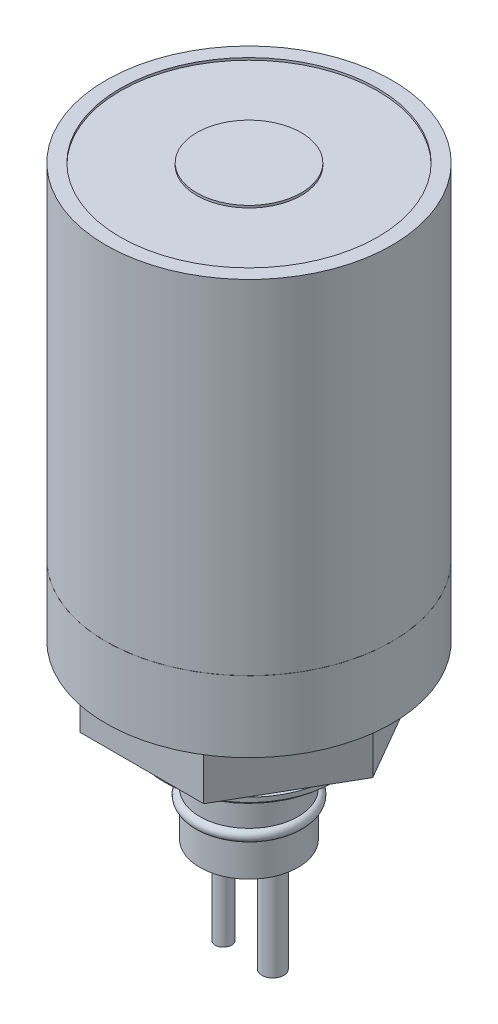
from build123d import *

# Parameters (mm, degrees)
SKETCH1_R                      = 15.875
BOSS_EXTRUDE1_DEPTH            = 38.1
BOSS_EXTRUDE2_START            = 0.0127
SKETCH2_R                      = 15.875
BOSS_EXTRUDE2_DEPTH            = 7.874
SKETCH3_R                      = 14.3002
SKETCH3_R_2                    = 5.800580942
CUT_EXTRUDE1_DEPTH             = 0.254
F_6_32_TAPPED_HOLE1_AT_2_COUNT = 2
F_6_32_TAPPED_HOLE1_AT_2_PITCH = 23.371860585
F_6_32_TAPPED_HOLE1_AT_3_COUNT = 2
F_6_32_TAPPED_HOLE1_AT_3_PITCH = 23.371860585
IMPULSE_VSF_BCL_DEPTH          = 6.2647068
SKETCH11_R                     = 0.905408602
SKETCH11_R_2                   = 1.21312683
BOSS_EXTRUDE5_DEPTH            = 11.176


with BuildPart() as part:
    # Sketch1 → Boss-Extrude1 (new body)
    with BuildSketch(Plane(origin=(0, 0, 0), x_dir=(1, 0, 0), z_dir=(0, 1, 0))):
        with Locations(Location((0, 0, 0), (0, 0, 270))):
            Circle(SKETCH1_R)
    extrude(amount=-BOSS_EXTRUDE1_DEPTH)

    # Sketch3 → Cut-Extrude1 (cut)
    with BuildSketch(Plane(origin=(0, 0, 0), x_dir=(1, 0, 0), z_dir=(0, 1, 0))):
        with Locations(Location((0, 0, 0), (0, 0, 270))):
            Circle(SKETCH3_R)
        with Locations(Location((0, 0, 0), (0, 0, 270))):
            Circle(SKETCH3_R_2, mode=Mode.SUBTRACT)
    extrude(amount=-CUT_EXTRUDE1_DEPTH, mode=Mode.SUBTRACT)


with BuildPart() as body_2:
    # Sketch2 → Boss-Extrude2 (new body)
    with BuildSketch(Plane.XZ.offset(38.1).offset(BOSS_EXTRUDE2_START)):
        with Locations(Location((0, 0, 0), (0, 0, 270))):
            Circle(SKETCH2_R)
    extrude(amount=BOSS_EXTRUDE2_DEPTH)


with BuildPart() as f_6_32_tapped_hole1_tool:
    # Sketch9 → 6-32 Tapped Hole1 (revolve)
    with BuildSketch(Plane(origin=(0, -45.9867, 13.49375), x_dir=(0, 0, -1), z_dir=(1, 0, 0))):
        Polygon((0, 0), (0, 10.21069403), (1.35255, 9.398), (1.35255, 0), align=None)
    f_6_32_tapped_hole1 = revolve(axis=Axis((0, -52.3367, 13.49375), (0, 1, 0)))


with BuildPart() as part_1:
    add(part.part)

    # 6-32 Tapped Hole1: cut by f_6_32_tapped_hole1_tool
    add(f_6_32_tapped_hole1_tool.part, mode=Mode.SUBTRACT)


with BuildPart() as body_2_1:
    add(body_2.part)

    # 6-32 Tapped Hole1: cut by f_6_32_tapped_hole1_tool
    add(f_6_32_tapped_hole1_tool.part, mode=Mode.SUBTRACT)


with BuildPart() as f_6_32_tapped_hole1_at_2_tool:
    # 6-32 Tapped Hole1 at 2: 6-32 Tapped Hole1 ×2
    with Locations(*[Vector(-0.4999999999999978, 0, -0.8660254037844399) * (i * F_6_32_TAPPED_HOLE1_AT_2_PITCH) for i in range(1, F_6_32_TAPPED_HOLE1_AT_2_COUNT)]):
        add(f_6_32_tapped_hole1)


with BuildPart() as part_2:
    add(part_1.part)

    # 6-32 Tapped Hole1 at 2: cut by f_6_32_tapped_hole1_at_2_tool
    add(f_6_32_tapped_hole1_at_2_tool.part, mode=Mode.SUBTRACT)


with BuildPart() as body_2_2:
    add(body_2_1.part)

    # 6-32 Tapped Hole1 at 2: cut by f_6_32_tapped_hole1_at_2_tool
    add(f_6_32_tapped_hole1_at_2_tool.part, mode=Mode.SUBTRACT)


with BuildPart() as f_6_32_tapped_hole1_at_3_tool:
    # 6-32 Tapped Hole1 at 3: 6-32 Tapped Hole1 ×2
    with Locations(*[Vector(0.4999999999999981, 0, -0.8660254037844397) * (i * F_6_32_TAPPED_HOLE1_AT_3_PITCH) for i in range(1, F_6_32_TAPPED_HOLE1_AT_3_COUNT)]):
        add(f_6_32_tapped_hole1)


with BuildPart() as part_3:
    add(part_2.part)

    # 6-32 Tapped Hole1 at 3: cut by f_6_32_tapped_hole1_at_3_tool
    add(f_6_32_tapped_hole1_at_3_tool.part, mode=Mode.SUBTRACT)


with BuildPart() as body_2_3:
    add(body_2_2.part)

    # 6-32 Tapped Hole1 at 3: cut by f_6_32_tapped_hole1_at_3_tool
    add(f_6_32_tapped_hole1_at_3_tool.part, mode=Mode.SUBTRACT)


with BuildPart() as f_7_16_20_tapped_hole1_tool:
    # Sketch12 → 7_16-20 Tapped Hole1 (revolve)
    with BuildSketch(Plane(origin=(-0.140879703, -45.9867, 0.085493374), x_dir=(0, 0, -1), z_dir=(1, 0, 0))):
        Polygon((0, 0), (0, 13.445441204), (4.96062, 10.4648), (4.96062, 0), align=None)
    revolve(axis=Axis((-0.140879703, -52.3367, 0.085493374), (0, 1, 0)))


with BuildPart() as part_4:
    add(part_3.part)

    # 7_16-20 Tapped Hole1: cut by f_7_16_20_tapped_hole1_tool
    add(f_7_16_20_tapped_hole1_tool.part, mode=Mode.SUBTRACT)


with BuildPart() as body_2_4:
    add(body_2_3.part)

    # 7_16-20 Tapped Hole1: cut by f_7_16_20_tapped_hole1_tool
    add(f_7_16_20_tapped_hole1_tool.part, mode=Mode.SUBTRACT)

    # Sketch6 → Impulse VSF-BCL (add)
    with BuildSketch(Plane.XZ.offset(45.9867)):
        Polygon((13.740820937, 0), (6.870410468, 11.8999), (-6.870410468, 11.8999), (-13.740820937, 0), (-6.870410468, -11.8999), (6.870410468, -11.8999), align=None)
    extrude(amount=IMPULSE_VSF_BCL_DEPTH)

    # Sketch7 → Revolve1 (revolve)
    with BuildSketch(Plane.XY, mode=Mode.PRIVATE) as revolve1_sk:
        with BuildLine():
            Line((0, -52.2514068), (8.801, -52.2514068))
            Line((8.801, -52.2514068), (8.801, -53.3489408))
            Line((8.801, -53.3489408), (9.398, -53.3489408))
            Line((9.398, -53.3489408), (9.398, -53.8569408))
            Line((9.398, -53.8569408), (8.801, -53.8569408))
            Line((8.801, -53.8569408), (8.801, -54.3649408))
            Line((8.801, -54.3649408), (9.398, -54.3649408))
            Line((9.398, -54.3649408), (9.398, -54.8729408))
            Line((9.398, -54.8729408), (8.801, -54.8729408))
            Line((8.801, -54.8729408), (8.801, -55.3809408))
            Line((8.801, -55.3809408), (5.45367483, -55.3809408))
            Line((5.45367483, -55.3809408), (5.45367483, -60.150665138))
            ThreePointArc((5.45367483, -60.150665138), (6.042647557, -60.739637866), (5.45367483, -61.328610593))
            Line((5.45367483, -61.328610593), (5.45367483, -65.0367))
            Line((5.45367483, -65.0367), (0, -65.0367))
            Line((0, -65.0367), (0, -55.3809408))
            Line((0, -55.3809408), (0, -52.2514068))
        make_face()
    revolve(revolve1_sk.sketch.rotate(Axis((0, 0, 0), (0, -1, 0)), 180), axis=Axis((0, 0, 0), (0, -1, 0)))

    # Sketch11 → Boss-Extrude5 (add)
    with BuildSketch(Plane.XZ.offset(65.0367)):
        with Locations(Location((-2.840493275, 0, 0), (0, 0, 180))):
            Circle(SKETCH11_R)
        with Locations(Location((2.647765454, 0, 0), (0, 0, 180))):
            Circle(SKETCH11_R_2)
    extrude(amount=BOSS_EXTRUDE5_DEPTH)


solid = Compound([part_4.part, body_2_4.part])
